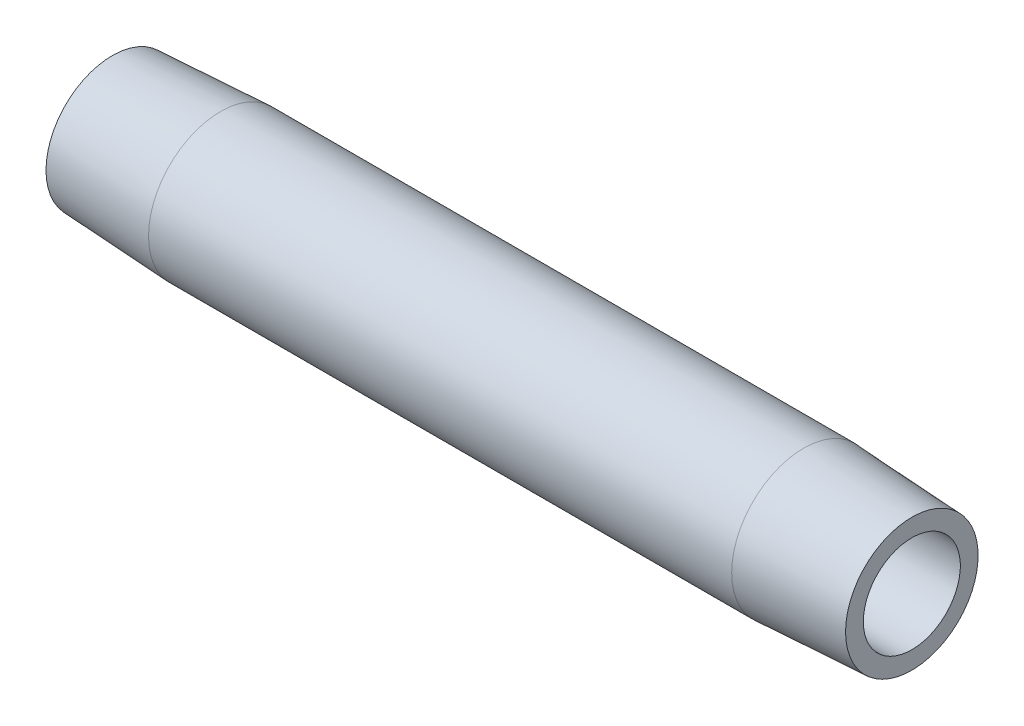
ISO-10303-21;
HEADER;
FILE_DESCRIPTION(('STEP AP214'),'2;1');
FILE_NAME('part.step','',(''),(''),'','','');
FILE_SCHEMA(('AUTOMOTIVE_DESIGN { 1 0 10303 214 1 1 1 1 }'));
ENDSEC;
DATA;
#1=APPLICATION_CONTEXT('core data for automotive mechanical design processes');
#2=APPLICATION_PROTOCOL_DEFINITION('international standard','automotive_design',2000,#1);
#3=PRODUCT_CONTEXT('',#1,'mechanical');
#4=PRODUCT('Part','Part','',(#3));
#5=PRODUCT_RELATED_PRODUCT_CATEGORY('part','',(#4));
#6=PRODUCT_DEFINITION_FORMATION('','',#4);
#7=PRODUCT_DEFINITION_CONTEXT('part definition',#1,'design');
#8=PRODUCT_DEFINITION('design','',#6,#7);
#9=PRODUCT_DEFINITION_SHAPE('','',#8);
#10=(LENGTH_UNIT() NAMED_UNIT(*) SI_UNIT(.MILLI.,.METRE.));
#11=(NAMED_UNIT(*) PLANE_ANGLE_UNIT() SI_UNIT($,.RADIAN.));
#12=(NAMED_UNIT(*) SI_UNIT($,.STERADIAN.) SOLID_ANGLE_UNIT());
#13=UNCERTAINTY_MEASURE_WITH_UNIT(LENGTH_MEASURE(1.E-05),#10,'distance_accuracy_value','');
#14=(GEOMETRIC_REPRESENTATION_CONTEXT(3) GLOBAL_UNCERTAINTY_ASSIGNED_CONTEXT((#13)) GLOBAL_UNIT_ASSIGNED_CONTEXT((#10,
#11,#12)) REPRESENTATION_CONTEXT('',''));
#15=CARTESIAN_POINT('',(0.,0.,0.));
#16=DIRECTION('',(0.,0.,1.));
#17=DIRECTION('',(1.,0.,0.));
#18=AXIS2_PLACEMENT_3D('',#15,#16,#17);
#19=CARTESIAN_POINT('',(76.2,0.,-4.62277681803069));
#20=DIRECTION('',(-1.,0.,0.));
#21=DIRECTION('',(0.,0.,1.));
#22=AXIS2_PLACEMENT_3D('',#19,#20,#21);
#23=PLANE('',#22);
#24=CARTESIAN_POINT('',(76.2,0.,0.));
#25=DIRECTION('',(-1.,0.,0.));
#26=DIRECTION('',(0.,0.,1.));
#27=AXIS2_PLACEMENT_3D('',#24,#25,#26);
#28=CIRCLE('',#27,6.31752683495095);
#29=CARTESIAN_POINT('',(76.2,0.,6.31752683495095));
#30=VERTEX_POINT('',#29);
#31=EDGE_CURVE('E10',#30,#30,#28,.T.);
#32=ORIENTED_EDGE('',*,*,#31,.F.);
#33=EDGE_LOOP('',(#32));
#34=FACE_BOUND('',#33,.T.);
#35=CARTESIAN_POINT('',(76.2,0.,0.));
#36=DIRECTION('',(-1.,0.,0.));
#37=DIRECTION('',(0.,0.,1.));
#38=AXIS2_PLACEMENT_3D('',#35,#36,#37);
#39=CIRCLE('',#38,4.62277681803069);
#40=CARTESIAN_POINT('',(76.2,0.,4.62277681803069));
#41=VERTEX_POINT('',#40);
#42=EDGE_CURVE('E52',#41,#41,#39,.T.);
#43=ORIENTED_EDGE('',*,*,#42,.T.);
#44=EDGE_LOOP('',(#43));
#45=FACE_BOUND('',#44,.T.);
#46=ADVANCED_FACE('F30',(#34,#45),#23,.F.);
#47=CARTESIAN_POINT('',(76.2,0.,0.));
#48=DIRECTION('',(-1.,0.,0.));
#49=DIRECTION('',(0.,0.,1.));
#50=AXIS2_PLACEMENT_3D('',#47,#48,#49);
#51=CONICAL_SURFACE('',#50,6.31752683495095,0.052359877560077);
#52=CARTESIAN_POINT('',(65.8876000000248,0.,0.));
#53=DIRECTION('',(-1.,0.,0.));
#54=DIRECTION('',(0.,0.,1.));
#55=AXIS2_PLACEMENT_3D('',#52,#53,#54);
#56=CIRCLE('',#55,6.85797681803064);
#57=CARTESIAN_POINT('',(65.8876000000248,0.,6.85797681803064));
#58=VERTEX_POINT('',#57);
#59=EDGE_CURVE('E36',#58,#58,#56,.T.);
#60=ORIENTED_EDGE('',*,*,#59,.F.);
#61=EDGE_LOOP('',(#60));
#62=FACE_BOUND('',#61,.T.);
#63=ORIENTED_EDGE('',*,*,#31,.T.);
#64=EDGE_LOOP('',(#63));
#65=FACE_BOUND('',#64,.T.);
#66=ADVANCED_FACE('F77',(#62,#65),#51,.T.);
#67=CARTESIAN_POINT('',(-6.37599469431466,0.,0.));
#68=DIRECTION('',(-1.,0.,0.));
#69=DIRECTION('',(0.,0.,1.));
#70=AXIS2_PLACEMENT_3D('',#67,#68,#69);
#71=CYLINDRICAL_SURFACE('',#70,6.85797681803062);
#72=CARTESIAN_POINT('',(10.3123999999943,0.,0.));
#73=DIRECTION('',(-1.,0.,0.));
#74=DIRECTION('',(0.,0.,1.));
#75=AXIS2_PLACEMENT_3D('',#72,#73,#74);
#76=CIRCLE('',#75,6.8579768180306);
#77=CARTESIAN_POINT('',(10.3123999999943,0.,6.8579768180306));
#78=VERTEX_POINT('',#77);
#79=EDGE_CURVE('E40',#78,#78,#76,.T.);
#80=ORIENTED_EDGE('',*,*,#79,.F.);
#81=EDGE_LOOP('',(#80));
#82=FACE_BOUND('',#81,.T.);
#83=ORIENTED_EDGE('',*,*,#59,.T.);
#84=EDGE_LOOP('',(#83));
#85=FACE_BOUND('',#84,.T.);
#86=ADVANCED_FACE('F72',(#82,#85),#71,.T.);
#87=CARTESIAN_POINT('',(10.3123999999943,0.,0.));
#88=DIRECTION('',(1.,0.,0.));
#89=DIRECTION('',(0.,0.,-1.));
#90=AXIS2_PLACEMENT_3D('',#87,#88,#89);
#91=CONICAL_SURFACE('',#90,6.8579768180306,0.0523598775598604);
#92=CARTESIAN_POINT('',(1.90819582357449E-11,0.,0.));
#93=DIRECTION('',(-1.,0.,0.));
#94=DIRECTION('',(0.,0.,1.));
#95=AXIS2_PLACEMENT_3D('',#92,#93,#94);
#96=CIRCLE('',#95,6.31752683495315);
#97=CARTESIAN_POINT('',(1.90819582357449E-11,0.,6.31752683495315));
#98=VERTEX_POINT('',#97);
#99=EDGE_CURVE('E44',#98,#98,#96,.T.);
#100=ORIENTED_EDGE('',*,*,#99,.F.);
#101=EDGE_LOOP('',(#100));
#102=FACE_BOUND('',#101,.T.);
#103=ORIENTED_EDGE('',*,*,#79,.T.);
#104=EDGE_LOOP('',(#103));
#105=FACE_BOUND('',#104,.T.);
#106=ADVANCED_FACE('F66',(#102,#105),#91,.T.);
#107=CARTESIAN_POINT('',(1.90819582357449E-11,0.,-6.31752683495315));
#108=DIRECTION('',(1.,0.,0.));
#109=DIRECTION('',(0.,0.,-1.));
#110=AXIS2_PLACEMENT_3D('',#107,#108,#109);
#111=PLANE('',#110);
#112=CARTESIAN_POINT('',(1.90819582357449E-11,0.,0.));
#113=DIRECTION('',(-1.,0.,0.));
#114=DIRECTION('',(0.,0.,1.));
#115=AXIS2_PLACEMENT_3D('',#112,#113,#114);
#116=CIRCLE('',#115,4.62277681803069);
#117=CARTESIAN_POINT('',(1.90819582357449E-11,0.,4.62277681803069));
#118=VERTEX_POINT('',#117);
#119=EDGE_CURVE('E49',#118,#118,#116,.T.);
#120=ORIENTED_EDGE('',*,*,#119,.F.);
#121=EDGE_LOOP('',(#120));
#122=FACE_BOUND('',#121,.T.);
#123=ORIENTED_EDGE('',*,*,#99,.T.);
#124=EDGE_LOOP('',(#123));
#125=FACE_BOUND('',#124,.T.);
#126=ADVANCED_FACE('F60',(#122,#125),#111,.F.);
#127=CARTESIAN_POINT('',(-6.37599469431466,0.,0.));
#128=DIRECTION('',(-1.,0.,0.));
#129=DIRECTION('',(0.,0.,1.));
#130=AXIS2_PLACEMENT_3D('',#127,#128,#129);
#131=CYLINDRICAL_SURFACE('',#130,4.62277681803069);
#132=ORIENTED_EDGE('',*,*,#42,.F.);
#133=EDGE_LOOP('',(#132));
#134=FACE_BOUND('',#133,.T.);
#135=ORIENTED_EDGE('',*,*,#119,.T.);
#136=EDGE_LOOP('',(#135));
#137=FACE_BOUND('',#136,.T.);
#138=ADVANCED_FACE('F57',(#134,#137),#131,.F.);
#139=CLOSED_SHELL('',(#46,#66,#86,#106,#126,#138));
#140=MANIFOLD_SOLID_BREP('B2',#139);
#141=ADVANCED_BREP_SHAPE_REPRESENTATION('',(#18,#140),#14);
#142=SHAPE_DEFINITION_REPRESENTATION(#9,#141);
ENDSEC;
END-ISO-10303-21;
